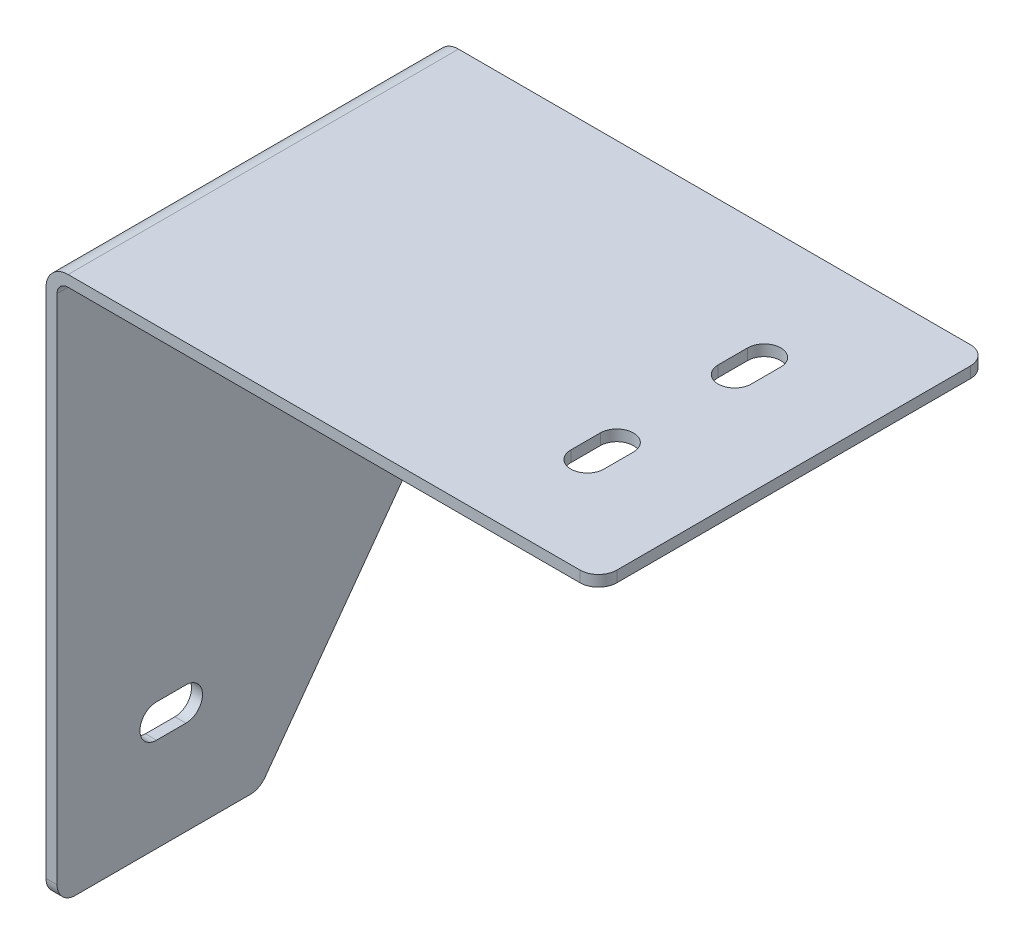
ISO-10303-21;
HEADER;
FILE_DESCRIPTION(('STEP AP214'),'2;1');
FILE_NAME('part.step','',(''),(''),'','','');
FILE_SCHEMA(('AUTOMOTIVE_DESIGN { 1 0 10303 214 1 1 1 1 }'));
ENDSEC;
DATA;
#1=APPLICATION_CONTEXT('core data for automotive mechanical design processes');
#2=APPLICATION_PROTOCOL_DEFINITION('international standard','automotive_design',2000,#1);
#3=PRODUCT_CONTEXT('',#1,'mechanical');
#4=PRODUCT('Part','Part','',(#3));
#5=PRODUCT_RELATED_PRODUCT_CATEGORY('part','',(#4));
#6=PRODUCT_DEFINITION_FORMATION('','',#4);
#7=PRODUCT_DEFINITION_CONTEXT('part definition',#1,'design');
#8=PRODUCT_DEFINITION('design','',#6,#7);
#9=PRODUCT_DEFINITION_SHAPE('','',#8);
#10=(LENGTH_UNIT() NAMED_UNIT(*) SI_UNIT(.MILLI.,.METRE.));
#11=(NAMED_UNIT(*) PLANE_ANGLE_UNIT() SI_UNIT($,.RADIAN.));
#12=(NAMED_UNIT(*) SI_UNIT($,.STERADIAN.) SOLID_ANGLE_UNIT());
#13=UNCERTAINTY_MEASURE_WITH_UNIT(LENGTH_MEASURE(1.E-05),#10,'distance_accuracy_value','');
#14=(GEOMETRIC_REPRESENTATION_CONTEXT(3) GLOBAL_UNCERTAINTY_ASSIGNED_CONTEXT((#13)) GLOBAL_UNIT_ASSIGNED_CONTEXT((#10,
#11,#12)) REPRESENTATION_CONTEXT('',''));
#15=CARTESIAN_POINT('',(0.,0.,0.));
#16=DIRECTION('',(0.,0.,1.));
#17=DIRECTION('',(1.,0.,0.));
#18=AXIS2_PLACEMENT_3D('',#15,#16,#17);
#19=CARTESIAN_POINT('',(147.,-117.,-35.));
#20=DIRECTION('',(-1.,0.,0.));
#21=DIRECTION('',(0.,0.,1.));
#22=AXIS2_PLACEMENT_3D('',#19,#20,#21);
#23=CYLINDRICAL_SURFACE('',#22,4.5);
#24=DIRECTION('',(1.,0.,0.));
#25=VECTOR('',#24,1.);
#26=CARTESIAN_POINT('',(147.,-112.5,-35.));
#27=LINE('',#26,#25);
#28=CARTESIAN_POINT('',(0.,-112.5,-35.));
#29=VERTEX_POINT('',#28);
#30=CARTESIAN_POINT('',(-3.,-112.5,-35.));
#31=VERTEX_POINT('',#30);
#32=EDGE_CURVE('E181',#29,#31,#27,.F.);
#33=ORIENTED_EDGE('',*,*,#32,.T.);
#34=CARTESIAN_POINT('',(-3.,-117.,-35.));
#35=DIRECTION('',(-1.,0.,0.));
#36=DIRECTION('',(0.,0.,1.));
#37=AXIS2_PLACEMENT_3D('',#34,#35,#36);
#38=CIRCLE('',#37,4.5);
#39=CARTESIAN_POINT('',(-3.,-121.5,-35.));
#40=VERTEX_POINT('',#39);
#41=EDGE_CURVE('E19',#40,#31,#38,.F.);
#42=ORIENTED_EDGE('',*,*,#41,.F.);
#43=DIRECTION('',(1.,0.,0.));
#44=VECTOR('',#43,1.);
#45=CARTESIAN_POINT('',(147.,-121.5,-35.));
#46=LINE('',#45,#44);
#47=CARTESIAN_POINT('',(0.,-121.5,-35.));
#48=VERTEX_POINT('',#47);
#49=EDGE_CURVE('E220',#40,#48,#46,.T.);
#50=ORIENTED_EDGE('',*,*,#49,.T.);
#51=CARTESIAN_POINT('',(0.,-117.,-35.));
#52=DIRECTION('',(-1.,0.,0.));
#53=DIRECTION('',(0.,0.,1.));
#54=AXIS2_PLACEMENT_3D('',#51,#52,#53);
#55=CIRCLE('',#54,4.5);
#56=EDGE_CURVE('E184',#29,#48,#55,.T.);
#57=ORIENTED_EDGE('',*,*,#56,.F.);
#58=EDGE_LOOP('',(#33,#42,#50,#57));
#59=FACE_BOUND('',#58,.T.);
#60=ADVANCED_FACE('F16',(#59),#23,.F.);
#61=CARTESIAN_POINT('',(147.,-121.5,-35.));
#62=DIRECTION('',(0.,-1.,0.));
#63=DIRECTION('',(0.,0.,-1.));
#64=AXIS2_PLACEMENT_3D('',#61,#62,#63);
#65=PLANE('',#64);
#66=ORIENTED_EDGE('',*,*,#49,.F.);
#67=DIRECTION('',(0.,0.,1.));
#68=VECTOR('',#67,1.);
#69=CARTESIAN_POINT('',(-2.99999999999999,-121.5,-106.));
#70=LINE('',#69,#68);
#71=CARTESIAN_POINT('',(-3.,-121.5,-27.));
#72=VERTEX_POINT('',#71);
#73=EDGE_CURVE('E202',#72,#40,#70,.F.);
#74=ORIENTED_EDGE('',*,*,#73,.F.);
#75=DIRECTION('',(-1.,0.,0.));
#76=VECTOR('',#75,1.);
#77=CARTESIAN_POINT('',(147.,-121.5,-27.));
#78=LINE('',#77,#76);
#79=CARTESIAN_POINT('',(0.,-121.5,-27.));
#80=VERTEX_POINT('',#79);
#81=EDGE_CURVE('E189',#72,#80,#78,.F.);
#82=ORIENTED_EDGE('',*,*,#81,.T.);
#83=DIRECTION('',(0.,0.,1.));
#84=VECTOR('',#83,1.);
#85=CARTESIAN_POINT('',(0.,-121.5,-106.));
#86=LINE('',#85,#84);
#87=EDGE_CURVE('E293',#48,#80,#86,.T.);
#88=ORIENTED_EDGE('',*,*,#87,.F.);
#89=EDGE_LOOP('',(#66,#74,#82,#88));
#90=FACE_BOUND('',#89,.T.);
#91=ADVANCED_FACE('F668',(#90),#65,.F.);
#92=CARTESIAN_POINT('',(147.,-117.,-27.));
#93=DIRECTION('',(-1.,0.,0.));
#94=DIRECTION('',(0.,0.,1.));
#95=AXIS2_PLACEMENT_3D('',#92,#93,#94);
#96=CYLINDRICAL_SURFACE('',#95,4.5);
#97=CARTESIAN_POINT('',(0.,-117.,-27.));
#98=DIRECTION('',(-1.,0.,0.));
#99=DIRECTION('',(0.,0.,1.));
#100=AXIS2_PLACEMENT_3D('',#97,#98,#99);
#101=CIRCLE('',#100,4.5);
#102=CARTESIAN_POINT('',(0.,-112.5,-27.));
#103=VERTEX_POINT('',#102);
#104=EDGE_CURVE('E289',#80,#103,#101,.T.);
#105=ORIENTED_EDGE('',*,*,#104,.F.);
#106=ORIENTED_EDGE('',*,*,#81,.F.);
#107=CARTESIAN_POINT('',(-3.,-117.,-27.));
#108=DIRECTION('',(-1.,0.,0.));
#109=DIRECTION('',(0.,0.,1.));
#110=AXIS2_PLACEMENT_3D('',#107,#108,#109);
#111=CIRCLE('',#110,4.5);
#112=CARTESIAN_POINT('',(-3.,-112.5,-27.));
#113=VERTEX_POINT('',#112);
#114=EDGE_CURVE('E197',#113,#72,#111,.F.);
#115=ORIENTED_EDGE('',*,*,#114,.F.);
#116=DIRECTION('',(1.,0.,0.));
#117=VECTOR('',#116,1.);
#118=CARTESIAN_POINT('',(147.,-112.5,-27.));
#119=LINE('',#118,#117);
#120=EDGE_CURVE('E188',#113,#103,#119,.T.);
#121=ORIENTED_EDGE('',*,*,#120,.T.);
#122=EDGE_LOOP('',(#105,#106,#115,#121));
#123=FACE_BOUND('',#122,.T.);
#124=ADVANCED_FACE('F660',(#123),#96,.F.);
#125=CARTESIAN_POINT('',(147.,-112.5,-35.));
#126=DIRECTION('',(0.,1.,0.));
#127=DIRECTION('',(0.,0.,1.));
#128=AXIS2_PLACEMENT_3D('',#125,#126,#127);
#129=PLANE('',#128);
#130=ORIENTED_EDGE('',*,*,#120,.F.);
#131=DIRECTION('',(0.,0.,1.));
#132=VECTOR('',#131,1.);
#133=CARTESIAN_POINT('',(-2.99999999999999,-112.5,-106.));
#134=LINE('',#133,#132);
#135=EDGE_CURVE('E193',#31,#113,#134,.T.);
#136=ORIENTED_EDGE('',*,*,#135,.F.);
#137=ORIENTED_EDGE('',*,*,#32,.F.);
#138=DIRECTION('',(0.,0.,1.));
#139=VECTOR('',#138,1.);
#140=CARTESIAN_POINT('',(0.,-112.5,-106.));
#141=LINE('',#140,#139);
#142=EDGE_CURVE('E292',#103,#29,#141,.F.);
#143=ORIENTED_EDGE('',*,*,#142,.F.);
#144=EDGE_LOOP('',(#130,#136,#137,#143));
#145=FACE_BOUND('',#144,.T.);
#146=ADVANCED_FACE('F194',(#145),#129,.F.);
#147=CARTESIAN_POINT('',(-2.99999999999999,-147.,-106.));
#148=DIRECTION('',(0.,-1.,0.));
#149=DIRECTION('',(0.,0.,-1.));
#150=AXIS2_PLACEMENT_3D('',#147,#148,#149);
#151=PLANE('',#150);
#152=DIRECTION('',(0.,0.,1.));
#153=VECTOR('',#152,1.);
#154=CARTESIAN_POINT('',(-2.99999999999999,-147.,-106.));
#155=LINE('',#154,#153);
#156=CARTESIAN_POINT('',(-2.99999999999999,-147.,-52.4565490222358));
#157=VERTEX_POINT('',#156);
#158=CARTESIAN_POINT('',(-2.99999999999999,-147.,-5.));
#159=VERTEX_POINT('',#158);
#160=EDGE_CURVE('E299',#157,#159,#155,.T.);
#161=ORIENTED_EDGE('',*,*,#160,.F.);
#162=DIRECTION('',(1.,0.,0.));
#163=VECTOR('',#162,1.);
#164=CARTESIAN_POINT('',(-2.99999999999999,-147.,-52.4565490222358));
#165=LINE('',#164,#163);
#166=CARTESIAN_POINT('',(0.,-147.,-52.4565490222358));
#167=VERTEX_POINT('',#166);
#168=EDGE_CURVE('E204',#167,#157,#165,.F.);
#169=ORIENTED_EDGE('',*,*,#168,.F.);
#170=DIRECTION('',(0.,0.,1.));
#171=VECTOR('',#170,1.);
#172=CARTESIAN_POINT('',(0.,-147.,-106.));
#173=LINE('',#172,#171);
#174=CARTESIAN_POINT('',(0.,-147.,-5.));
#175=VERTEX_POINT('',#174);
#176=EDGE_CURVE('E284',#175,#167,#173,.F.);
#177=ORIENTED_EDGE('',*,*,#176,.F.);
#178=DIRECTION('',(-1.,0.,0.));
#179=VECTOR('',#178,1.);
#180=CARTESIAN_POINT('',(3.,-147.,-5.00000000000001));
#181=LINE('',#180,#179);
#182=EDGE_CURVE('E203',#159,#175,#181,.F.);
#183=ORIENTED_EDGE('',*,*,#182,.F.);
#184=EDGE_LOOP('',(#161,#169,#177,#183));
#185=FACE_BOUND('',#184,.T.);
#186=ADVANCED_FACE('F360',(#185),#151,.T.);
#187=CARTESIAN_POINT('',(-2.99999999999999,-142.,-52.4565490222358));
#188=DIRECTION('',(1.,0.,0.));
#189=DIRECTION('',(0.,0.,-1.));
#190=AXIS2_PLACEMENT_3D('',#187,#188,#189);
#191=CYLINDRICAL_SURFACE('',#190,5.);
#192=CARTESIAN_POINT('',(-2.99999999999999,-142.,-52.4565490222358));
#193=DIRECTION('',(1.,0.,0.));
#194=DIRECTION('',(0.,0.,-1.));
#195=AXIS2_PLACEMENT_3D('',#192,#193,#194);
#196=CIRCLE('',#195,5.);
#197=CARTESIAN_POINT('',(-3.,-144.944290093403,-56.4977315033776));
#198=VERTEX_POINT('',#197);
#199=EDGE_CURVE('E216',#198,#157,#196,.F.);
#200=ORIENTED_EDGE('',*,*,#199,.F.);
#201=DIRECTION('',(1.,0.,0.));
#202=VECTOR('',#201,1.);
#203=CARTESIAN_POINT('',(147.,-144.944290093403,-56.4977315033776));
#204=LINE('',#203,#202);
#205=CARTESIAN_POINT('',(0.,-144.944290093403,-56.4977315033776));
#206=VERTEX_POINT('',#205);
#207=EDGE_CURVE('E213',#198,#206,#204,.T.);
#208=ORIENTED_EDGE('',*,*,#207,.T.);
#209=CARTESIAN_POINT('',(0.,-142.,-52.4565490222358));
#210=DIRECTION('',(1.,0.,0.));
#211=DIRECTION('',(0.,0.,-1.));
#212=AXIS2_PLACEMENT_3D('',#209,#210,#211);
#213=CIRCLE('',#212,5.);
#214=EDGE_CURVE('E281',#167,#206,#213,.T.);
#215=ORIENTED_EDGE('',*,*,#214,.F.);
#216=ORIENTED_EDGE('',*,*,#168,.T.);
#217=EDGE_LOOP('',(#200,#208,#215,#216));
#218=FACE_BOUND('',#217,.T.);
#219=ADVANCED_FACE('F358',(#218),#191,.T.);
#220=CARTESIAN_POINT('',(3.,-142.,-5.));
#221=DIRECTION('',(-1.,0.,0.));
#222=DIRECTION('',(0.,0.,1.));
#223=AXIS2_PLACEMENT_3D('',#220,#221,#222);
#224=CYLINDRICAL_SURFACE('',#223,5.);
#225=CARTESIAN_POINT('',(-2.99999999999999,-142.,-5.));
#226=DIRECTION('',(-1.,0.,0.));
#227=DIRECTION('',(0.,0.,1.));
#228=AXIS2_PLACEMENT_3D('',#225,#226,#227);
#229=CIRCLE('',#228,5.);
#230=CARTESIAN_POINT('',(-2.99999999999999,-142.,0.));
#231=VERTEX_POINT('',#230);
#232=EDGE_CURVE('E298',#159,#231,#229,.T.);
#233=ORIENTED_EDGE('',*,*,#232,.F.);
#234=ORIENTED_EDGE('',*,*,#182,.T.);
#235=CARTESIAN_POINT('',(0.,-142.,-5.));
#236=DIRECTION('',(-1.,0.,0.));
#237=DIRECTION('',(0.,0.,1.));
#238=AXIS2_PLACEMENT_3D('',#235,#236,#237);
#239=CIRCLE('',#238,5.);
#240=CARTESIAN_POINT('',(0.,-142.,0.));
#241=VERTEX_POINT('',#240);
#242=EDGE_CURVE('E285',#241,#175,#239,.F.);
#243=ORIENTED_EDGE('',*,*,#242,.F.);
#244=DIRECTION('',(1.,0.,0.));
#245=VECTOR('',#244,1.);
#246=CARTESIAN_POINT('',(3.,-142.,0.));
#247=LINE('',#246,#245);
#248=EDGE_CURVE('E308',#231,#241,#247,.T.);
#249=ORIENTED_EDGE('',*,*,#248,.F.);
#250=EDGE_LOOP('',(#233,#234,#243,#249));
#251=FACE_BOUND('',#250,.T.);
#252=ADVANCED_FACE('F364',(#251),#224,.T.);
#253=CARTESIAN_POINT('',(3.,-2.99999999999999,-106.));
#254=DIRECTION('',(0.,0.,1.));
#255=DIRECTION('',(1.,0.,0.));
#256=AXIS2_PLACEMENT_3D('',#253,#254,#255);
#257=CYLINDRICAL_SURFACE('',#256,6.);
#258=CARTESIAN_POINT('',(3.,-2.99999999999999,-106.));
#259=DIRECTION('',(0.,0.,1.));
#260=DIRECTION('',(1.,0.,0.));
#261=AXIS2_PLACEMENT_3D('',#258,#259,#260);
#262=CIRCLE('',#261,6.);
#263=CARTESIAN_POINT('',(3.,3.,-106.));
#264=VERTEX_POINT('',#263);
#265=CARTESIAN_POINT('',(-2.99999999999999,-2.99999999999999,-106.));
#266=VERTEX_POINT('',#265);
#267=EDGE_CURVE('E253',#264,#266,#262,.T.);
#268=ORIENTED_EDGE('',*,*,#267,.T.);
#269=DIRECTION('',(0.,0.,1.));
#270=VECTOR('',#269,1.);
#271=CARTESIAN_POINT('',(-2.99999999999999,-2.99999999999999,-106.));
#272=LINE('',#271,#270);
#273=CARTESIAN_POINT('',(-2.99999999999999,-2.99999999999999,0.));
#274=VERTEX_POINT('',#273);
#275=EDGE_CURVE('E297',#274,#266,#272,.F.);
#276=ORIENTED_EDGE('',*,*,#275,.F.);
#277=CARTESIAN_POINT('',(3.,-2.99999999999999,0.));
#278=DIRECTION('',(0.,0.,1.));
#279=DIRECTION('',(1.,0.,0.));
#280=AXIS2_PLACEMENT_3D('',#277,#278,#279);
#281=CIRCLE('',#280,6.);
#282=CARTESIAN_POINT('',(3.,3.,0.));
#283=VERTEX_POINT('',#282);
#284=EDGE_CURVE('E260',#283,#274,#281,.T.);
#285=ORIENTED_EDGE('',*,*,#284,.F.);
#286=DIRECTION('',(0.,0.,1.));
#287=VECTOR('',#286,1.);
#288=CARTESIAN_POINT('',(3.,3.00000000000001,-106.));
#289=LINE('',#288,#287);
#290=EDGE_CURVE('E280',#264,#283,#289,.T.);
#291=ORIENTED_EDGE('',*,*,#290,.F.);
#292=EDGE_LOOP('',(#268,#276,#285,#291));
#293=FACE_BOUND('',#292,.T.);
#294=ADVANCED_FACE('F427',(#293),#257,.T.);
#295=CARTESIAN_POINT('',(-2.99999999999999,-2.99999999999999,-106.));
#296=DIRECTION('',(-1.,0.,0.));
#297=DIRECTION('',(0.,0.,1.));
#298=AXIS2_PLACEMENT_3D('',#295,#296,#297);
#299=PLANE('',#298);
#300=DIRECTION('',(0.,-0.808236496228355,0.588858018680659));
#301=VECTOR('',#300,1.);
#302=CARTESIAN_POINT('',(-3.,-77.,-106.));
#303=LINE('',#302,#301);
#304=CARTESIAN_POINT('',(-3.,-77.,-106.));
#305=VERTEX_POINT('',#304);
#306=EDGE_CURVE('E215',#305,#198,#303,.T.);
#307=ORIENTED_EDGE('',*,*,#306,.T.);
#308=ORIENTED_EDGE('',*,*,#199,.T.);
#309=ORIENTED_EDGE('',*,*,#160,.T.);
#310=ORIENTED_EDGE('',*,*,#232,.T.);
#311=DIRECTION('',(0.,1.,0.));
#312=VECTOR('',#311,1.);
#313=CARTESIAN_POINT('',(-2.99999999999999,-3.,0.));
#314=LINE('',#313,#312);
#315=EDGE_CURVE('E263',#274,#231,#314,.F.);
#316=ORIENTED_EDGE('',*,*,#315,.F.);
#317=ORIENTED_EDGE('',*,*,#275,.T.);
#318=DIRECTION('',(0.,1.,0.));
#319=VECTOR('',#318,1.);
#320=CARTESIAN_POINT('',(-2.99999999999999,-3.,-106.));
#321=LINE('',#320,#319);
#322=EDGE_CURVE('E255',#266,#305,#321,.F.);
#323=ORIENTED_EDGE('',*,*,#322,.T.);
#324=EDGE_LOOP('',(#307,#308,#309,#310,#316,#317,#323));
#325=FACE_BOUND('',#324,.T.);
#326=ORIENTED_EDGE('',*,*,#114,.T.);
#327=ORIENTED_EDGE('',*,*,#73,.T.);
#328=ORIENTED_EDGE('',*,*,#41,.T.);
#329=ORIENTED_EDGE('',*,*,#135,.T.);
#330=EDGE_LOOP('',(#326,#327,#328,#329));
#331=FACE_BOUND('',#330,.T.);
#332=ADVANCED_FACE('F200',(#325,#331),#299,.T.);
#333=CARTESIAN_POINT('',(147.,-77.,-106.));
#334=DIRECTION('',(0.,0.588858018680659,0.808236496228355));
#335=DIRECTION('',(0.,-0.808236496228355,0.588858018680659));
#336=AXIS2_PLACEMENT_3D('',#333,#334,#335);
#337=PLANE('',#336);
#338=DIRECTION('',(1.,0.,0.));
#339=VECTOR('',#338,1.);
#340=CARTESIAN_POINT('',(3.,-77.,-106.));
#341=LINE('',#340,#339);
#342=CARTESIAN_POINT('',(0.,-77.,-106.));
#343=VERTEX_POINT('',#342);
#344=EDGE_CURVE('E340',#305,#343,#341,.T.);
#345=ORIENTED_EDGE('',*,*,#344,.T.);
#346=DIRECTION('',(0.,0.808236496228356,-0.588858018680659));
#347=VECTOR('',#346,1.);
#348=CARTESIAN_POINT('',(0.,-144.944290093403,-56.4977315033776));
#349=LINE('',#348,#347);
#350=EDGE_CURVE('E288',#206,#343,#349,.T.);
#351=ORIENTED_EDGE('',*,*,#350,.F.);
#352=ORIENTED_EDGE('',*,*,#207,.F.);
#353=ORIENTED_EDGE('',*,*,#306,.F.);
#354=EDGE_LOOP('',(#345,#351,#352,#353));
#355=FACE_BOUND('',#354,.T.);
#356=ADVANCED_FACE('F355',(#355),#337,.F.);
#357=CARTESIAN_POINT('',(0.,-147.,-106.));
#358=DIRECTION('',(1.,0.,0.));
#359=DIRECTION('',(0.,1.,0.));
#360=AXIS2_PLACEMENT_3D('',#357,#358,#359);
#361=PLANE('',#360);
#362=ORIENTED_EDGE('',*,*,#176,.T.);
#363=ORIENTED_EDGE('',*,*,#214,.T.);
#364=ORIENTED_EDGE('',*,*,#350,.T.);
#365=DIRECTION('',(0.,1.,0.));
#366=VECTOR('',#365,1.);
#367=CARTESIAN_POINT('',(0.,-3.,-106.));
#368=LINE('',#367,#366);
#369=CARTESIAN_POINT('',(0.,-3.00000000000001,-106.));
#370=VERTEX_POINT('',#369);
#371=EDGE_CURVE('E252',#343,#370,#368,.T.);
#372=ORIENTED_EDGE('',*,*,#371,.T.);
#373=DIRECTION('',(0.,0.,1.));
#374=VECTOR('',#373,1.);
#375=CARTESIAN_POINT('',(0.,-3.00000000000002,-106.));
#376=LINE('',#375,#374);
#377=CARTESIAN_POINT('',(0.,-3.00000000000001,0.));
#378=VERTEX_POINT('',#377);
#379=EDGE_CURVE('E259',#370,#378,#376,.T.);
#380=ORIENTED_EDGE('',*,*,#379,.T.);
#381=DIRECTION('',(0.,1.,0.));
#382=VECTOR('',#381,1.);
#383=CARTESIAN_POINT('',(0.,-3.,0.));
#384=LINE('',#383,#382);
#385=EDGE_CURVE('E377',#241,#378,#384,.T.);
#386=ORIENTED_EDGE('',*,*,#385,.F.);
#387=ORIENTED_EDGE('',*,*,#242,.T.);
#388=EDGE_LOOP('',(#362,#363,#364,#372,#380,#386,#387));
#389=FACE_BOUND('',#388,.T.);
#390=ORIENTED_EDGE('',*,*,#104,.T.);
#391=ORIENTED_EDGE('',*,*,#142,.T.);
#392=ORIENTED_EDGE('',*,*,#56,.T.);
#393=ORIENTED_EDGE('',*,*,#87,.T.);
#394=EDGE_LOOP('',(#390,#391,#392,#393));
#395=FACE_BOUND('',#394,.T.);
#396=ADVANCED_FACE('F466',(#389,#395),#361,.T.);
#397=CARTESIAN_POINT('',(147.,2.99999999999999,-106.));
#398=DIRECTION('',(0.,1.,0.));
#399=DIRECTION('',(-1.,0.,0.));
#400=AXIS2_PLACEMENT_3D('',#397,#398,#399);
#401=PLANE('',#400);
#402=DIRECTION('',(1.,0.,0.));
#403=VECTOR('',#402,1.);
#404=CARTESIAN_POINT('',(3.,2.99999999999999,0.));
#405=LINE('',#404,#403);
#406=CARTESIAN_POINT('',(142.,2.99999999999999,0.));
#407=VERTEX_POINT('',#406);
#408=EDGE_CURVE('E264',#407,#283,#405,.F.);
#409=ORIENTED_EDGE('',*,*,#408,.F.);
#410=CARTESIAN_POINT('',(142.,2.99999999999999,-5.));
#411=DIRECTION('',(0.,-1.,0.));
#412=DIRECTION('',(0.,0.,-1.));
#413=AXIS2_PLACEMENT_3D('',#410,#411,#412);
#414=CIRCLE('',#413,5.);
#415=CARTESIAN_POINT('',(147.,2.99999999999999,-5.));
#416=VERTEX_POINT('',#415);
#417=EDGE_CURVE('E242',#416,#407,#414,.T.);
#418=ORIENTED_EDGE('',*,*,#417,.F.);
#419=DIRECTION('',(0.,0.,-1.));
#420=VECTOR('',#419,1.);
#421=CARTESIAN_POINT('',(147.,2.99999999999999,-106.));
#422=LINE('',#421,#420);
#423=CARTESIAN_POINT('',(147.,2.99999999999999,-101.));
#424=VERTEX_POINT('',#423);
#425=EDGE_CURVE('E246',#424,#416,#422,.F.);
#426=ORIENTED_EDGE('',*,*,#425,.F.);
#427=CARTESIAN_POINT('',(142.,2.99999999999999,-101.));
#428=DIRECTION('',(0.,1.,0.));
#429=DIRECTION('',(0.,0.,1.));
#430=AXIS2_PLACEMENT_3D('',#427,#428,#429);
#431=CIRCLE('',#430,5.);
#432=CARTESIAN_POINT('',(142.,2.99999999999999,-106.));
#433=VERTEX_POINT('',#432);
#434=EDGE_CURVE('E247',#433,#424,#431,.F.);
#435=ORIENTED_EDGE('',*,*,#434,.F.);
#436=DIRECTION('',(1.,0.,0.));
#437=VECTOR('',#436,1.);
#438=CARTESIAN_POINT('',(3.,2.99999999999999,-106.));
#439=LINE('',#438,#437);
#440=EDGE_CURVE('E256',#433,#264,#439,.F.);
#441=ORIENTED_EDGE('',*,*,#440,.T.);
#442=ORIENTED_EDGE('',*,*,#290,.T.);
#443=EDGE_LOOP('',(#409,#418,#426,#435,#441,#442));
#444=FACE_BOUND('',#443,.T.);
#445=CARTESIAN_POINT('',(117.,3.,-35.));
#446=DIRECTION('',(0.,1.,0.));
#447=DIRECTION('',(-1.,0.,0.));
#448=AXIS2_PLACEMENT_3D('',#445,#446,#447);
#449=CIRCLE('',#448,4.49999999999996);
#450=CARTESIAN_POINT('',(112.5,3.,-35.));
#451=VERTEX_POINT('',#450);
#452=CARTESIAN_POINT('',(121.5,3.,-35.));
#453=VERTEX_POINT('',#452);
#454=EDGE_CURVE('E265',#451,#453,#449,.F.);
#455=ORIENTED_EDGE('',*,*,#454,.T.);
#456=DIRECTION('',(0.,0.,1.));
#457=VECTOR('',#456,1.);
#458=CARTESIAN_POINT('',(121.5,3.,-27.));
#459=LINE('',#458,#457);
#460=CARTESIAN_POINT('',(121.5,3.,-27.));
#461=VERTEX_POINT('',#460);
#462=EDGE_CURVE('E271',#453,#461,#459,.T.);
#463=ORIENTED_EDGE('',*,*,#462,.T.);
#464=CARTESIAN_POINT('',(117.,3.,-27.));
#465=DIRECTION('',(0.,1.,0.));
#466=DIRECTION('',(-1.,0.,0.));
#467=AXIS2_PLACEMENT_3D('',#464,#465,#466);
#468=CIRCLE('',#467,4.49999999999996);
#469=CARTESIAN_POINT('',(112.5,3.,-27.));
#470=VERTEX_POINT('',#469);
#471=EDGE_CURVE('E269',#461,#470,#468,.F.);
#472=ORIENTED_EDGE('',*,*,#471,.T.);
#473=DIRECTION('',(0.,0.,1.));
#474=VECTOR('',#473,1.);
#475=CARTESIAN_POINT('',(112.5,3.,-27.));
#476=LINE('',#475,#474);
#477=EDGE_CURVE('E311',#470,#451,#476,.F.);
#478=ORIENTED_EDGE('',*,*,#477,.T.);
#479=EDGE_LOOP('',(#455,#463,#472,#478));
#480=FACE_BOUND('',#479,.T.);
#481=CARTESIAN_POINT('',(117.,3.,-75.));
#482=DIRECTION('',(0.,1.,0.));
#483=DIRECTION('',(-1.,0.,0.));
#484=AXIS2_PLACEMENT_3D('',#481,#482,#483);
#485=CIRCLE('',#484,4.5);
#486=CARTESIAN_POINT('',(112.5,3.,-75.));
#487=VERTEX_POINT('',#486);
#488=CARTESIAN_POINT('',(121.5,3.,-75.));
#489=VERTEX_POINT('',#488);
#490=EDGE_CURVE('E273',#487,#489,#485,.F.);
#491=ORIENTED_EDGE('',*,*,#490,.T.);
#492=DIRECTION('',(0.,0.,1.));
#493=VECTOR('',#492,1.);
#494=CARTESIAN_POINT('',(121.5,3.,-67.));
#495=LINE('',#494,#493);
#496=CARTESIAN_POINT('',(121.5,3.,-67.));
#497=VERTEX_POINT('',#496);
#498=EDGE_CURVE('E279',#489,#497,#495,.T.);
#499=ORIENTED_EDGE('',*,*,#498,.T.);
#500=CARTESIAN_POINT('',(117.,3.,-67.));
#501=DIRECTION('',(0.,1.,0.));
#502=DIRECTION('',(-1.,0.,0.));
#503=AXIS2_PLACEMENT_3D('',#500,#501,#502);
#504=CIRCLE('',#503,4.5);
#505=CARTESIAN_POINT('',(112.5,3.,-67.));
#506=VERTEX_POINT('',#505);
#507=EDGE_CURVE('E277',#497,#506,#504,.F.);
#508=ORIENTED_EDGE('',*,*,#507,.T.);
#509=DIRECTION('',(0.,0.,1.));
#510=VECTOR('',#509,1.);
#511=CARTESIAN_POINT('',(112.5,3.,-67.));
#512=LINE('',#511,#510);
#513=EDGE_CURVE('E316',#506,#487,#512,.F.);
#514=ORIENTED_EDGE('',*,*,#513,.T.);
#515=EDGE_LOOP('',(#491,#499,#508,#514));
#516=FACE_BOUND('',#515,.T.);
#517=ADVANCED_FACE('F420',(#444,#480,#516),#401,.T.);
#518=CARTESIAN_POINT('',(117.,-147.,-67.));
#519=DIRECTION('',(0.,1.,0.));
#520=DIRECTION('',(-1.,0.,0.));
#521=AXIS2_PLACEMENT_3D('',#518,#519,#520);
#522=CYLINDRICAL_SURFACE('',#521,4.5);
#523=DIRECTION('',(0.,-1.,0.));
#524=VECTOR('',#523,1.);
#525=CARTESIAN_POINT('',(112.5,-147.,-67.));
#526=LINE('',#525,#524);
#527=CARTESIAN_POINT('',(112.5,0.,-67.));
#528=VERTEX_POINT('',#527);
#529=EDGE_CURVE('E317',#528,#506,#526,.F.);
#530=ORIENTED_EDGE('',*,*,#529,.T.);
#531=ORIENTED_EDGE('',*,*,#507,.F.);
#532=DIRECTION('',(0.,1.,0.));
#533=VECTOR('',#532,1.);
#534=CARTESIAN_POINT('',(121.5,-147.,-67.));
#535=LINE('',#534,#533);
#536=CARTESIAN_POINT('',(121.5,0.,-67.));
#537=VERTEX_POINT('',#536);
#538=EDGE_CURVE('E276',#497,#537,#535,.F.);
#539=ORIENTED_EDGE('',*,*,#538,.T.);
#540=CARTESIAN_POINT('',(117.,0.,-67.));
#541=DIRECTION('',(0.,1.,0.));
#542=DIRECTION('',(-1.,0.,0.));
#543=AXIS2_PLACEMENT_3D('',#540,#541,#542);
#544=CIRCLE('',#543,4.5);
#545=EDGE_CURVE('E239',#528,#537,#544,.T.);
#546=ORIENTED_EDGE('',*,*,#545,.F.);
#547=EDGE_LOOP('',(#530,#531,#539,#546));
#548=FACE_BOUND('',#547,.T.);
#549=ADVANCED_FACE('F465',(#548),#522,.F.);
#550=CARTESIAN_POINT('',(121.5,-147.,-67.));
#551=DIRECTION('',(1.,0.,0.));
#552=DIRECTION('',(0.,1.,0.));
#553=AXIS2_PLACEMENT_3D('',#550,#551,#552);
#554=PLANE('',#553);
#555=ORIENTED_EDGE('',*,*,#538,.F.);
#556=ORIENTED_EDGE('',*,*,#498,.F.);
#557=DIRECTION('',(0.,1.,0.));
#558=VECTOR('',#557,1.);
#559=CARTESIAN_POINT('',(121.5,-147.,-75.));
#560=LINE('',#559,#558);
#561=CARTESIAN_POINT('',(121.5,0.,-75.));
#562=VERTEX_POINT('',#561);
#563=EDGE_CURVE('E275',#489,#562,#560,.F.);
#564=ORIENTED_EDGE('',*,*,#563,.T.);
#565=DIRECTION('',(0.,0.,-1.));
#566=VECTOR('',#565,1.);
#567=CARTESIAN_POINT('',(121.5,0.,-106.));
#568=LINE('',#567,#566);
#569=EDGE_CURVE('E238',#537,#562,#568,.T.);
#570=ORIENTED_EDGE('',*,*,#569,.F.);
#571=EDGE_LOOP('',(#555,#556,#564,#570));
#572=FACE_BOUND('',#571,.T.);
#573=ADVANCED_FACE('F390',(#572),#554,.F.);
#574=CARTESIAN_POINT('',(117.,-147.,-75.));
#575=DIRECTION('',(0.,1.,0.));
#576=DIRECTION('',(-1.,0.,0.));
#577=AXIS2_PLACEMENT_3D('',#574,#575,#576);
#578=CYLINDRICAL_SURFACE('',#577,4.5);
#579=ORIENTED_EDGE('',*,*,#563,.F.);
#580=ORIENTED_EDGE('',*,*,#490,.F.);
#581=DIRECTION('',(0.,-1.,0.));
#582=VECTOR('',#581,1.);
#583=CARTESIAN_POINT('',(112.5,-147.,-75.));
#584=LINE('',#583,#582);
#585=CARTESIAN_POINT('',(112.5,0.,-75.));
#586=VERTEX_POINT('',#585);
#587=EDGE_CURVE('E272',#487,#586,#584,.T.);
#588=ORIENTED_EDGE('',*,*,#587,.T.);
#589=CARTESIAN_POINT('',(117.,0.,-75.));
#590=DIRECTION('',(0.,1.,0.));
#591=DIRECTION('',(-1.,0.,0.));
#592=AXIS2_PLACEMENT_3D('',#589,#590,#591);
#593=CIRCLE('',#592,4.5);
#594=EDGE_CURVE('E235',#562,#586,#593,.T.);
#595=ORIENTED_EDGE('',*,*,#594,.F.);
#596=EDGE_LOOP('',(#579,#580,#588,#595));
#597=FACE_BOUND('',#596,.T.);
#598=ADVANCED_FACE('F394',(#597),#578,.F.);
#599=CARTESIAN_POINT('',(112.5,-147.,-67.));
#600=DIRECTION('',(-1.,0.,0.));
#601=DIRECTION('',(0.,-1.,0.));
#602=AXIS2_PLACEMENT_3D('',#599,#600,#601);
#603=PLANE('',#602);
#604=ORIENTED_EDGE('',*,*,#587,.F.);
#605=ORIENTED_EDGE('',*,*,#513,.F.);
#606=ORIENTED_EDGE('',*,*,#529,.F.);
#607=DIRECTION('',(0.,0.,-1.));
#608=VECTOR('',#607,1.);
#609=CARTESIAN_POINT('',(112.5,0.,-106.));
#610=LINE('',#609,#608);
#611=EDGE_CURVE('E234',#586,#528,#610,.F.);
#612=ORIENTED_EDGE('',*,*,#611,.F.);
#613=EDGE_LOOP('',(#604,#605,#606,#612));
#614=FACE_BOUND('',#613,.T.);
#615=ADVANCED_FACE('F469',(#614),#603,.F.);
#616=CARTESIAN_POINT('',(117.,-147.,-27.));
#617=DIRECTION('',(0.,1.,0.));
#618=DIRECTION('',(-1.,0.,0.));
#619=AXIS2_PLACEMENT_3D('',#616,#617,#618);
#620=CYLINDRICAL_SURFACE('',#619,4.49999999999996);
#621=DIRECTION('',(0.,-1.,0.));
#622=VECTOR('',#621,1.);
#623=CARTESIAN_POINT('',(112.5,-147.,-27.));
#624=LINE('',#623,#622);
#625=CARTESIAN_POINT('',(112.5,0.,-27.));
#626=VERTEX_POINT('',#625);
#627=EDGE_CURVE('E314',#626,#470,#624,.F.);
#628=ORIENTED_EDGE('',*,*,#627,.T.);
#629=ORIENTED_EDGE('',*,*,#471,.F.);
#630=DIRECTION('',(0.,1.,0.));
#631=VECTOR('',#630,1.);
#632=CARTESIAN_POINT('',(121.5,-147.,-27.));
#633=LINE('',#632,#631);
#634=CARTESIAN_POINT('',(121.5,0.,-27.));
#635=VERTEX_POINT('',#634);
#636=EDGE_CURVE('E268',#461,#635,#633,.F.);
#637=ORIENTED_EDGE('',*,*,#636,.T.);
#638=CARTESIAN_POINT('',(117.,0.,-27.));
#639=DIRECTION('',(0.,1.,0.));
#640=DIRECTION('',(-1.,0.,0.));
#641=AXIS2_PLACEMENT_3D('',#638,#639,#640);
#642=CIRCLE('',#641,4.49999999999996);
#643=EDGE_CURVE('E231',#626,#635,#642,.T.);
#644=ORIENTED_EDGE('',*,*,#643,.F.);
#645=EDGE_LOOP('',(#628,#629,#637,#644));
#646=FACE_BOUND('',#645,.T.);
#647=ADVANCED_FACE('F463',(#646),#620,.F.);
#648=CARTESIAN_POINT('',(121.5,-147.,-27.));
#649=DIRECTION('',(1.,0.,0.));
#650=DIRECTION('',(0.,1.,0.));
#651=AXIS2_PLACEMENT_3D('',#648,#649,#650);
#652=PLANE('',#651);
#653=ORIENTED_EDGE('',*,*,#636,.F.);
#654=ORIENTED_EDGE('',*,*,#462,.F.);
#655=DIRECTION('',(0.,1.,0.));
#656=VECTOR('',#655,1.);
#657=CARTESIAN_POINT('',(121.5,-147.,-35.));
#658=LINE('',#657,#656);
#659=CARTESIAN_POINT('',(121.5,0.,-35.));
#660=VERTEX_POINT('',#659);
#661=EDGE_CURVE('E267',#453,#660,#658,.F.);
#662=ORIENTED_EDGE('',*,*,#661,.T.);
#663=DIRECTION('',(0.,0.,-1.));
#664=VECTOR('',#663,1.);
#665=CARTESIAN_POINT('',(121.5,0.,-106.));
#666=LINE('',#665,#664);
#667=EDGE_CURVE('E230',#635,#660,#666,.T.);
#668=ORIENTED_EDGE('',*,*,#667,.F.);
#669=EDGE_LOOP('',(#653,#654,#662,#668));
#670=FACE_BOUND('',#669,.T.);
#671=ADVANCED_FACE('F449',(#670),#652,.F.);
#672=CARTESIAN_POINT('',(117.,-147.,-35.));
#673=DIRECTION('',(0.,1.,0.));
#674=DIRECTION('',(-1.,0.,0.));
#675=AXIS2_PLACEMENT_3D('',#672,#673,#674);
#676=CYLINDRICAL_SURFACE('',#675,4.49999999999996);
#677=ORIENTED_EDGE('',*,*,#661,.F.);
#678=ORIENTED_EDGE('',*,*,#454,.F.);
#679=DIRECTION('',(0.,-1.,0.));
#680=VECTOR('',#679,1.);
#681=CARTESIAN_POINT('',(112.5,-147.,-35.));
#682=LINE('',#681,#680);
#683=CARTESIAN_POINT('',(112.5,0.,-35.));
#684=VERTEX_POINT('',#683);
#685=EDGE_CURVE('E313',#451,#684,#682,.T.);
#686=ORIENTED_EDGE('',*,*,#685,.T.);
#687=CARTESIAN_POINT('',(117.,0.,-35.));
#688=DIRECTION('',(0.,1.,0.));
#689=DIRECTION('',(-1.,0.,0.));
#690=AXIS2_PLACEMENT_3D('',#687,#688,#689);
#691=CIRCLE('',#690,4.49999999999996);
#692=EDGE_CURVE('E226',#660,#684,#691,.T.);
#693=ORIENTED_EDGE('',*,*,#692,.F.);
#694=EDGE_LOOP('',(#677,#678,#686,#693));
#695=FACE_BOUND('',#694,.T.);
#696=ADVANCED_FACE('F454',(#695),#676,.F.);
#697=CARTESIAN_POINT('',(112.5,-147.,-27.));
#698=DIRECTION('',(-1.,0.,0.));
#699=DIRECTION('',(0.,-1.,0.));
#700=AXIS2_PLACEMENT_3D('',#697,#698,#699);
#701=PLANE('',#700);
#702=ORIENTED_EDGE('',*,*,#685,.F.);
#703=ORIENTED_EDGE('',*,*,#477,.F.);
#704=ORIENTED_EDGE('',*,*,#627,.F.);
#705=DIRECTION('',(0.,0.,-1.));
#706=VECTOR('',#705,1.);
#707=CARTESIAN_POINT('',(112.5,0.,-106.));
#708=LINE('',#707,#706);
#709=EDGE_CURVE('E229',#684,#626,#708,.F.);
#710=ORIENTED_EDGE('',*,*,#709,.F.);
#711=EDGE_LOOP('',(#702,#703,#704,#710));
#712=FACE_BOUND('',#711,.T.);
#713=ADVANCED_FACE('F460',(#712),#701,.F.);
#714=CARTESIAN_POINT('',(3.,-3.,0.));
#715=DIRECTION('',(0.,0.,1.));
#716=DIRECTION('',(1.,0.,0.));
#717=AXIS2_PLACEMENT_3D('',#714,#715,#716);
#718=PLANE('',#717);
#719=ORIENTED_EDGE('',*,*,#315,.T.);
#720=ORIENTED_EDGE('',*,*,#248,.T.);
#721=ORIENTED_EDGE('',*,*,#385,.T.);
#722=CARTESIAN_POINT('',(3.,-3.,0.));
#723=DIRECTION('',(0.,0.,1.));
#724=DIRECTION('',(1.,0.,0.));
#725=AXIS2_PLACEMENT_3D('',#722,#723,#724);
#726=CIRCLE('',#725,3.);
#727=CARTESIAN_POINT('',(3.00000000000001,0.,0.));
#728=VERTEX_POINT('',#727);
#729=EDGE_CURVE('E257',#378,#728,#726,.F.);
#730=ORIENTED_EDGE('',*,*,#729,.T.);
#731=DIRECTION('',(1.,0.,0.));
#732=VECTOR('',#731,1.);
#733=CARTESIAN_POINT('',(3.00000000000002,0.,0.));
#734=LINE('',#733,#732);
#735=CARTESIAN_POINT('',(142.,0.,0.));
#736=VERTEX_POINT('',#735);
#737=EDGE_CURVE('E441',#736,#728,#734,.F.);
#738=ORIENTED_EDGE('',*,*,#737,.F.);
#739=DIRECTION('',(0.,-1.,0.));
#740=VECTOR('',#739,1.);
#741=CARTESIAN_POINT('',(142.,-3.,0.));
#742=LINE('',#741,#740);
#743=EDGE_CURVE('E245',#407,#736,#742,.T.);
#744=ORIENTED_EDGE('',*,*,#743,.F.);
#745=ORIENTED_EDGE('',*,*,#408,.T.);
#746=ORIENTED_EDGE('',*,*,#284,.T.);
#747=EDGE_LOOP('',(#719,#720,#721,#730,#738,#744,#745,#746));
#748=FACE_BOUND('',#747,.T.);
#749=ADVANCED_FACE('F368',(#748),#718,.T.);
#750=CARTESIAN_POINT('',(3.,-3.,-106.));
#751=DIRECTION('',(0.,0.,1.));
#752=DIRECTION('',(1.,0.,0.));
#753=AXIS2_PLACEMENT_3D('',#750,#751,#752);
#754=CYLINDRICAL_SURFACE('',#753,3.);
#755=ORIENTED_EDGE('',*,*,#379,.F.);
#756=CARTESIAN_POINT('',(3.,-3.,-106.));
#757=DIRECTION('',(0.,0.,1.));
#758=DIRECTION('',(1.,0.,0.));
#759=AXIS2_PLACEMENT_3D('',#756,#757,#758);
#760=CIRCLE('',#759,3.);
#761=CARTESIAN_POINT('',(3.00000000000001,0.,-106.));
#762=VERTEX_POINT('',#761);
#763=EDGE_CURVE('E250',#370,#762,#760,.F.);
#764=ORIENTED_EDGE('',*,*,#763,.T.);
#765=DIRECTION('',(0.,0.,-1.));
#766=VECTOR('',#765,1.);
#767=CARTESIAN_POINT('',(3.00000000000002,0.,-106.));
#768=LINE('',#767,#766);
#769=EDGE_CURVE('E374',#728,#762,#768,.T.);
#770=ORIENTED_EDGE('',*,*,#769,.F.);
#771=ORIENTED_EDGE('',*,*,#729,.F.);
#772=EDGE_LOOP('',(#755,#764,#770,#771));
#773=FACE_BOUND('',#772,.T.);
#774=ADVANCED_FACE('F494',(#773),#754,.F.);
#775=CARTESIAN_POINT('',(3.,-3.,-106.));
#776=DIRECTION('',(0.,0.,1.));
#777=DIRECTION('',(1.,0.,0.));
#778=AXIS2_PLACEMENT_3D('',#775,#776,#777);
#779=PLANE('',#778);
#780=ORIENTED_EDGE('',*,*,#763,.F.);
#781=ORIENTED_EDGE('',*,*,#371,.F.);
#782=ORIENTED_EDGE('',*,*,#344,.F.);
#783=ORIENTED_EDGE('',*,*,#322,.F.);
#784=ORIENTED_EDGE('',*,*,#267,.F.);
#785=ORIENTED_EDGE('',*,*,#440,.F.);
#786=DIRECTION('',(0.,1.,0.));
#787=VECTOR('',#786,1.);
#788=CARTESIAN_POINT('',(142.,0.,-106.));
#789=LINE('',#788,#787);
#790=CARTESIAN_POINT('',(142.,0.,-106.));
#791=VERTEX_POINT('',#790);
#792=EDGE_CURVE('E249',#791,#433,#789,.T.);
#793=ORIENTED_EDGE('',*,*,#792,.F.);
#794=DIRECTION('',(1.,0.,0.));
#795=VECTOR('',#794,1.);
#796=CARTESIAN_POINT('',(3.00000000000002,0.,-106.));
#797=LINE('',#796,#795);
#798=EDGE_CURVE('E225',#762,#791,#797,.T.);
#799=ORIENTED_EDGE('',*,*,#798,.F.);
#800=EDGE_LOOP('',(#780,#781,#782,#783,#784,#785,#793,#799));
#801=FACE_BOUND('',#800,.T.);
#802=ADVANCED_FACE('F425',(#801),#779,.F.);
#803=CARTESIAN_POINT('',(142.,0.,-101.));
#804=DIRECTION('',(0.,1.,0.));
#805=DIRECTION('',(0.,0.,1.));
#806=AXIS2_PLACEMENT_3D('',#803,#804,#805);
#807=CYLINDRICAL_SURFACE('',#806,5.);
#808=CARTESIAN_POINT('',(142.,0.,-101.));
#809=DIRECTION('',(0.,1.,0.));
#810=DIRECTION('',(0.,0.,1.));
#811=AXIS2_PLACEMENT_3D('',#808,#809,#810);
#812=CIRCLE('',#811,5.);
#813=CARTESIAN_POINT('',(147.,0.,-101.));
#814=VERTEX_POINT('',#813);
#815=EDGE_CURVE('E222',#791,#814,#812,.F.);
#816=ORIENTED_EDGE('',*,*,#815,.F.);
#817=ORIENTED_EDGE('',*,*,#792,.T.);
#818=ORIENTED_EDGE('',*,*,#434,.T.);
#819=DIRECTION('',(0.,1.,0.));
#820=VECTOR('',#819,1.);
#821=CARTESIAN_POINT('',(147.,0.,-101.));
#822=LINE('',#821,#820);
#823=EDGE_CURVE('E329',#814,#424,#822,.T.);
#824=ORIENTED_EDGE('',*,*,#823,.F.);
#825=EDGE_LOOP('',(#816,#817,#818,#824));
#826=FACE_BOUND('',#825,.T.);
#827=ADVANCED_FACE('F488',(#826),#807,.T.);
#828=CARTESIAN_POINT('',(147.,0.,-106.));
#829=DIRECTION('',(1.,0.,0.));
#830=DIRECTION('',(0.,0.,-1.));
#831=AXIS2_PLACEMENT_3D('',#828,#829,#830);
#832=PLANE('',#831);
#833=ORIENTED_EDGE('',*,*,#425,.T.);
#834=DIRECTION('',(0.,-1.,0.));
#835=VECTOR('',#834,1.);
#836=CARTESIAN_POINT('',(147.,-3.,-5.));
#837=LINE('',#836,#835);
#838=CARTESIAN_POINT('',(147.,0.,-5.));
#839=VERTEX_POINT('',#838);
#840=EDGE_CURVE('E34',#839,#416,#837,.F.);
#841=ORIENTED_EDGE('',*,*,#840,.F.);
#842=DIRECTION('',(0.,0.,-1.));
#843=VECTOR('',#842,1.);
#844=CARTESIAN_POINT('',(147.,0.,-106.));
#845=LINE('',#844,#843);
#846=EDGE_CURVE('E25',#814,#839,#845,.F.);
#847=ORIENTED_EDGE('',*,*,#846,.F.);
#848=ORIENTED_EDGE('',*,*,#823,.T.);
#849=EDGE_LOOP('',(#833,#841,#847,#848));
#850=FACE_BOUND('',#849,.T.);
#851=ADVANCED_FACE('F430',(#850),#832,.T.);
#852=CARTESIAN_POINT('',(142.,-3.,-5.));
#853=DIRECTION('',(0.,-1.,0.));
#854=DIRECTION('',(0.,0.,-1.));
#855=AXIS2_PLACEMENT_3D('',#852,#853,#854);
#856=CYLINDRICAL_SURFACE('',#855,5.);
#857=CARTESIAN_POINT('',(142.,0.,-5.));
#858=DIRECTION('',(0.,-1.,0.));
#859=DIRECTION('',(0.,0.,-1.));
#860=AXIS2_PLACEMENT_3D('',#857,#858,#859);
#861=CIRCLE('',#860,5.);
#862=EDGE_CURVE('E11',#839,#736,#861,.T.);
#863=ORIENTED_EDGE('',*,*,#862,.F.);
#864=ORIENTED_EDGE('',*,*,#840,.T.);
#865=ORIENTED_EDGE('',*,*,#417,.T.);
#866=ORIENTED_EDGE('',*,*,#743,.T.);
#867=EDGE_LOOP('',(#863,#864,#865,#866));
#868=FACE_BOUND('',#867,.T.);
#869=ADVANCED_FACE('F431',(#868),#856,.T.);
#870=CARTESIAN_POINT('',(3.00000000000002,0.,-106.));
#871=DIRECTION('',(0.,-1.,0.));
#872=DIRECTION('',(0.,0.,-1.));
#873=AXIS2_PLACEMENT_3D('',#870,#871,#872);
#874=PLANE('',#873);
#875=ORIENTED_EDGE('',*,*,#846,.T.);
#876=ORIENTED_EDGE('',*,*,#862,.T.);
#877=ORIENTED_EDGE('',*,*,#737,.T.);
#878=ORIENTED_EDGE('',*,*,#769,.T.);
#879=ORIENTED_EDGE('',*,*,#798,.T.);
#880=ORIENTED_EDGE('',*,*,#815,.T.);
#881=EDGE_LOOP('',(#875,#876,#877,#878,#879,#880));
#882=FACE_BOUND('',#881,.T.);
#883=ORIENTED_EDGE('',*,*,#692,.T.);
#884=ORIENTED_EDGE('',*,*,#709,.T.);
#885=ORIENTED_EDGE('',*,*,#643,.T.);
#886=ORIENTED_EDGE('',*,*,#667,.T.);
#887=EDGE_LOOP('',(#883,#884,#885,#886));
#888=FACE_BOUND('',#887,.T.);
#889=ORIENTED_EDGE('',*,*,#594,.T.);
#890=ORIENTED_EDGE('',*,*,#611,.T.);
#891=ORIENTED_EDGE('',*,*,#545,.T.);
#892=ORIENTED_EDGE('',*,*,#569,.T.);
#893=EDGE_LOOP('',(#889,#890,#891,#892));
#894=FACE_BOUND('',#893,.T.);
#895=ADVANCED_FACE('F399',(#882,#888,#894),#874,.T.);
#896=CLOSED_SHELL('',(#60,#91,#124,#146,#186,#219,#252,#294,#332,#356,#396,#517,#549,#573,#598,
#615,#647,#671,#696,#713,#749,#774,#802,#827,#851,#869,#895));
#897=MANIFOLD_SOLID_BREP('B1',#896);
#898=ADVANCED_BREP_SHAPE_REPRESENTATION('',(#18,#897),#14);
#899=SHAPE_DEFINITION_REPRESENTATION(#9,#898);
ENDSEC;
END-ISO-10303-21;
